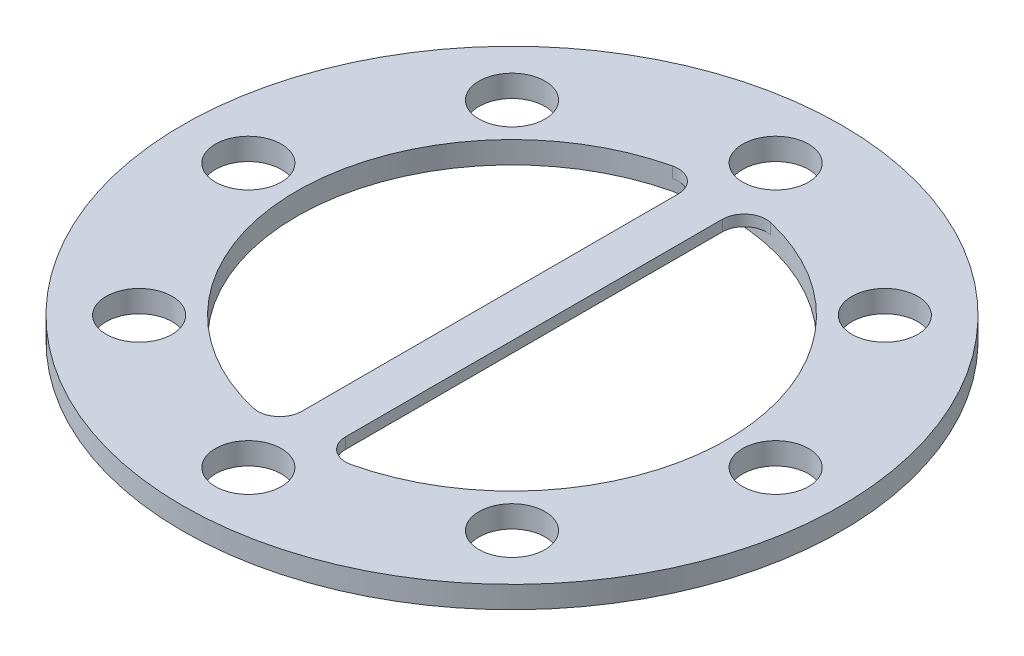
from build123d import *

# Parameters (mm, degrees)
SKETCH1_R           = 47.625
SKETCH1_R_2         = 31.115
SKETCH1_R_3         = 4.7625
BOSS_EXTRUDE1_DEPTH = 3.175
BOSS_EXTRUDE2_START = -1.5875
BOSS_EXTRUDE2_DEPTH = 1.5875
FILLET1_R           = 3.175


with BuildPart() as part:
    # Sketch1 → Boss-Extrude1 (new body)
    with BuildSketch(Plane(origin=(0, 0, 0), x_dir=(1, 0, 0), z_dir=(0, 1, 0))):
        with Locations(Location((0, 0, 0), (0, 0, 270))):
            Circle(SKETCH1_R)
        with Locations(Location((0, 0, 0), (0, 0, 270))):
            Circle(SKETCH1_R_2, mode=Mode.SUBTRACT)
        with Locations(Location((0, 38.1, 0), (0, 0, 270))):
            Circle(SKETCH1_R_3, mode=Mode.SUBTRACT)
        with Locations(Location((26.940768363, 26.940768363, 0), (0, 0, 270))):
            Circle(SKETCH1_R_3, mode=Mode.SUBTRACT)
        with Locations(Location((38.1, 0, 0), (0, 0, 270))):
            Circle(SKETCH1_R_3, mode=Mode.SUBTRACT)
        with Locations(Location((26.940768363, -26.940768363, 0), (0, 0, 270))):
            Circle(SKETCH1_R_3, mode=Mode.SUBTRACT)
        with Locations(Location((0, -38.1, 0), (0, 0, 270))):
            Circle(SKETCH1_R_3, mode=Mode.SUBTRACT)
        with Locations(Location((-26.940768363, -26.940768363, 0), (0, 0, 270))):
            Circle(SKETCH1_R_3, mode=Mode.SUBTRACT)
        with Locations(Location((-38.1, 0, 0), (0, 0, 270))):
            Circle(SKETCH1_R_3, mode=Mode.SUBTRACT)
        with Locations(Location((-26.940768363, 26.940768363, 0), (0, 0, 270))):
            Circle(SKETCH1_R_3, mode=Mode.SUBTRACT)
    extrude(amount=BOSS_EXTRUDE1_DEPTH)

    # Sketch2 → Boss-Extrude2 (add)
    with BuildSketch(Plane(origin=(0, 3.175, 0), x_dir=(1, 0, 0), z_dir=(0, 1, 0)).offset(BOSS_EXTRUDE2_START)):
        with BuildLine():
            ThreePointArc((-3.175, -30.952586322), (0, -31.115), (3.175, -30.952586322))
            Line((3.175, -30.952586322), (3.175, 30.952586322))
            ThreePointArc((3.175, 30.952586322), (0, 31.115), (-3.175, 30.952586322))
            Line((-3.175, 30.952586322), (-3.175, -30.952586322))
        make_face()
    extrude(amount=BOSS_EXTRUDE2_DEPTH)

    # Fillet1
    fillet1_edges = [part.edges().sort_by_distance(p)[0] for p in [
        (3.175, 2.38125, -30.952586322),
        (-3.175, 2.38125, -30.952586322),
        (3.175, 2.38125, 30.952586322),
        (-3.175, 2.38125, 30.952586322),
    ]]
    fillet(fillet1_edges, radius=FILLET1_R)


solid = part.part
